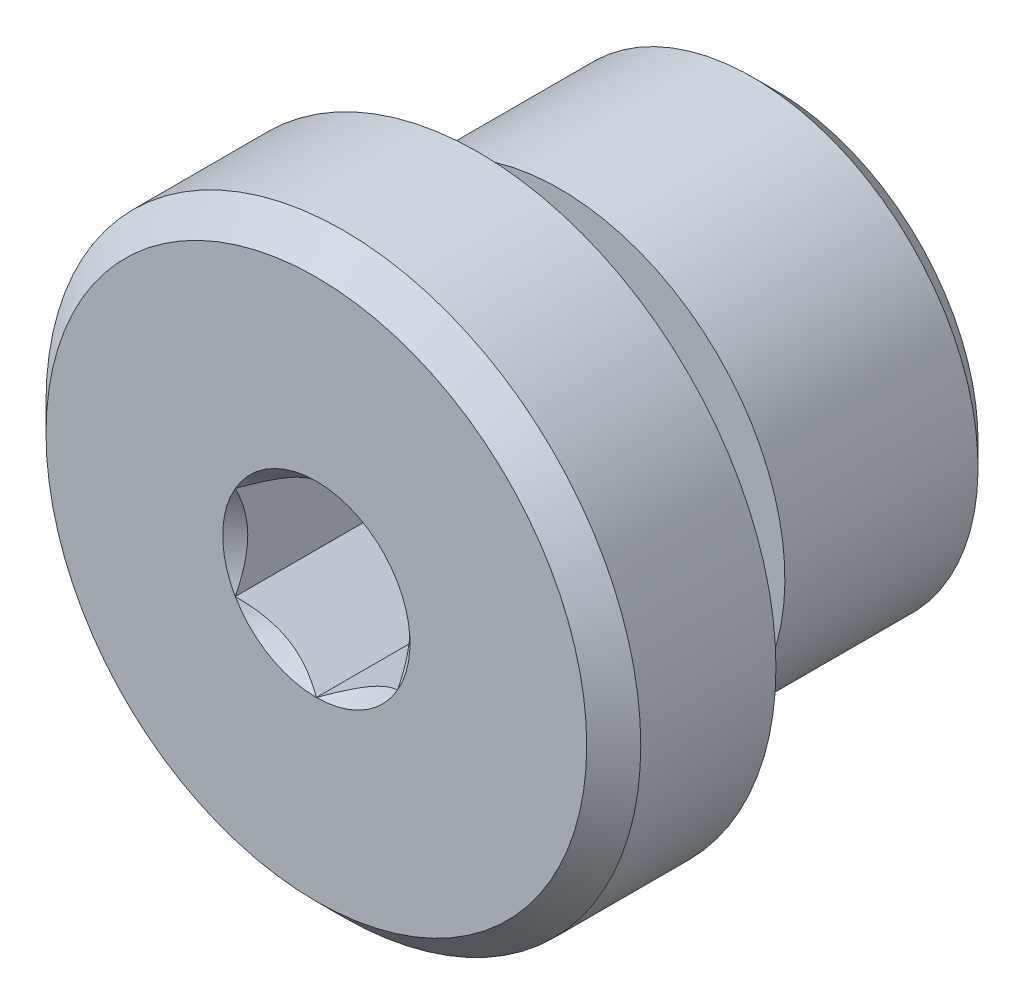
ISO-10303-21;
HEADER;
FILE_DESCRIPTION(('STEP AP214'),'2;1');
FILE_NAME('part.step','',(''),(''),'','','');
FILE_SCHEMA(('AUTOMOTIVE_DESIGN { 1 0 10303 214 1 1 1 1 }'));
ENDSEC;
DATA;
#1=APPLICATION_CONTEXT('core data for automotive mechanical design processes');
#2=APPLICATION_PROTOCOL_DEFINITION('international standard','automotive_design',2000,#1);
#3=PRODUCT_CONTEXT('',#1,'mechanical');
#4=PRODUCT('Part','Part','',(#3));
#5=PRODUCT_RELATED_PRODUCT_CATEGORY('part','',(#4));
#6=PRODUCT_DEFINITION_FORMATION('','',#4);
#7=PRODUCT_DEFINITION_CONTEXT('part definition',#1,'design');
#8=PRODUCT_DEFINITION('design','',#6,#7);
#9=PRODUCT_DEFINITION_SHAPE('','',#8);
#10=(LENGTH_UNIT() NAMED_UNIT(*) SI_UNIT(.MILLI.,.METRE.));
#11=(NAMED_UNIT(*) PLANE_ANGLE_UNIT() SI_UNIT($,.RADIAN.));
#12=(NAMED_UNIT(*) SI_UNIT($,.STERADIAN.) SOLID_ANGLE_UNIT());
#13=UNCERTAINTY_MEASURE_WITH_UNIT(LENGTH_MEASURE(1.E-05),#10,'distance_accuracy_value','');
#14=(GEOMETRIC_REPRESENTATION_CONTEXT(3) GLOBAL_UNCERTAINTY_ASSIGNED_CONTEXT((#13)) GLOBAL_UNIT_ASSIGNED_CONTEXT((#10,
#11,#12)) REPRESENTATION_CONTEXT('',''));
#15=CARTESIAN_POINT('',(0.,0.,0.));
#16=DIRECTION('',(0.,0.,1.));
#17=DIRECTION('',(1.,0.,0.));
#18=AXIS2_PLACEMENT_3D('',#15,#16,#17);
#19=CARTESIAN_POINT('',(0.,0.,0.));
#20=DIRECTION('',(0.,0.,1.));
#21=DIRECTION('',(0.,-1.,0.));
#22=AXIS2_PLACEMENT_3D('',#19,#20,#21);
#23=PLANE('',#22);
#24=DIRECTION('',(-0.866025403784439,0.5,0.));
#25=VECTOR('',#24,1.);
#26=CARTESIAN_POINT('',(3.,1.73205080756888,0.));
#27=LINE('',#26,#25);
#28=CARTESIAN_POINT('',(3.,1.73205080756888,0.));
#29=VERTEX_POINT('',#28);
#30=CARTESIAN_POINT('',(0.,3.46410161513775,0.));
#31=VERTEX_POINT('',#30);
#32=EDGE_CURVE('E64',#29,#31,#27,.T.);
#33=ORIENTED_EDGE('',*,*,#32,.T.);
#34=DIRECTION('',(-0.866025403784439,-0.5,0.));
#35=VECTOR('',#34,1.);
#36=CARTESIAN_POINT('',(0.,3.46410161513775,0.));
#37=LINE('',#36,#35);
#38=CARTESIAN_POINT('',(-3.,1.73205080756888,0.));
#39=VERTEX_POINT('',#38);
#40=EDGE_CURVE('E78',#31,#39,#37,.T.);
#41=ORIENTED_EDGE('',*,*,#40,.T.);
#42=DIRECTION('',(0.,-1.,0.));
#43=VECTOR('',#42,1.);
#44=CARTESIAN_POINT('',(-3.,1.73205080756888,0.));
#45=LINE('',#44,#43);
#46=CARTESIAN_POINT('',(-3.,-1.73205080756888,0.));
#47=VERTEX_POINT('',#46);
#48=EDGE_CURVE('E81',#39,#47,#45,.T.);
#49=ORIENTED_EDGE('',*,*,#48,.T.);
#50=DIRECTION('',(0.866025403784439,-0.5,0.));
#51=VECTOR('',#50,1.);
#52=CARTESIAN_POINT('',(-3.,-1.73205080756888,0.));
#53=LINE('',#52,#51);
#54=CARTESIAN_POINT('',(0.,-3.46410161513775,0.));
#55=VERTEX_POINT('',#54);
#56=EDGE_CURVE('E96',#47,#55,#53,.T.);
#57=ORIENTED_EDGE('',*,*,#56,.T.);
#58=DIRECTION('',(0.866025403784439,0.5,0.));
#59=VECTOR('',#58,1.);
#60=CARTESIAN_POINT('',(0.,-3.46410161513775,0.));
#61=LINE('',#60,#59);
#62=CARTESIAN_POINT('',(3.,-1.73205080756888,0.));
#63=VERTEX_POINT('',#62);
#64=EDGE_CURVE('E272',#55,#63,#61,.T.);
#65=ORIENTED_EDGE('',*,*,#64,.T.);
#66=DIRECTION('',(0.,1.,0.));
#67=VECTOR('',#66,1.);
#68=CARTESIAN_POINT('',(3.,-1.73205080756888,0.));
#69=LINE('',#68,#67);
#70=EDGE_CURVE('E69',#63,#29,#69,.T.);
#71=ORIENTED_EDGE('',*,*,#70,.T.);
#72=EDGE_LOOP('',(#33,#41,#49,#57,#65,#71));
#73=FACE_BOUND('',#72,.T.);
#74=ADVANCED_FACE('F14',(#73),#23,.T.);
#75=CARTESIAN_POINT('',(0.,3.46410161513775,0.));
#76=DIRECTION('',(-0.5,0.866025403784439,0.));
#77=DIRECTION('',(-0.866025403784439,-0.5,0.));
#78=AXIS2_PLACEMENT_3D('',#75,#76,#77);
#79=PLANE('',#78);
#80=ORIENTED_EDGE('',*,*,#40,.F.);
#81=DIRECTION('',(0.,0.,1.));
#82=VECTOR('',#81,1.);
#83=CARTESIAN_POINT('',(0.,3.46410161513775,0.));
#84=LINE('',#83,#82);
#85=CARTESIAN_POINT('',(0.,3.46410161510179,6.00000000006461));
#86=VERTEX_POINT('',#85);
#87=EDGE_CURVE('E56',#31,#86,#84,.T.);
#88=ORIENTED_EDGE('',*,*,#87,.T.);
#89=CARTESIAN_POINT('',(-4.33370467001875E-11,3.46410161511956,6.00000000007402));
#90=CARTESIAN_POINT('',(-0.103111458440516,3.40457018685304,5.94052569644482));
#91=CARTESIAN_POINT('',(-0.207946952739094,3.34404338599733,5.8845449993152));
#92=CARTESIAN_POINT('',(-0.421717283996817,3.22062302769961,5.7820467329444));
#93=CARTESIAN_POINT('',(-0.530672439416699,3.15771773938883,5.73558617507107));
#94=CARTESIAN_POINT('',(-0.750375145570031,3.03087232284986,5.65599891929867));
#95=CARTESIAN_POINT('',(-0.861066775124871,2.96696448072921,5.62267223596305));
#96=CARTESIAN_POINT('',(-1.08488631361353,2.83774220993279,5.57132616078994));
#97=CARTESIAN_POINT('',(-1.19800738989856,2.77243172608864,5.55326845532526));
#98=CARTESIAN_POINT('',(-1.39297651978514,2.65986624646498,5.53697523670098));
#99=CARTESIAN_POINT('',(-1.47457294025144,2.61275653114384,5.53456399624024));
#100=CARTESIAN_POINT('',(-1.63763295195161,2.51861378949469,5.53863151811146));
#101=CARTESIAN_POINT('',(-1.71909648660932,2.47158079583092,5.54511339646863));
#102=CARTESIAN_POINT('',(-1.88125166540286,2.37796045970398,5.56659704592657));
#103=CARTESIAN_POINT('',(-1.96194234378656,2.33137367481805,5.58160834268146));
#104=CARTESIAN_POINT('',(-2.12193782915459,2.2390002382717,5.61933151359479));
#105=CARTESIAN_POINT('',(-2.2012427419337,2.19321352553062,5.64204279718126));
#106=CARTESIAN_POINT('',(-2.34201325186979,2.11193963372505,5.68876371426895));
#107=CARTESIAN_POINT('',(-2.4037908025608,2.07627234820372,5.71154386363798));
#108=CARTESIAN_POINT('',(-2.52623714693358,2.00557791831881,5.76077453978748));
#109=CARTESIAN_POINT('',(-2.58690590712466,1.97055079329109,5.78722517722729));
#110=CARTESIAN_POINT('',(-2.70694350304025,1.90124705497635,5.84320408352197));
#111=CARTESIAN_POINT('',(-2.76631575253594,1.86696847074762,5.87272267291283));
#112=CARTESIAN_POINT('',(-2.88396102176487,1.79904594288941,5.93445005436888));
#113=CARTESIAN_POINT('',(-2.94223468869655,1.76540162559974,5.96665719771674));
#114=CARTESIAN_POINT('',(-2.99999999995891,1.73205080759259,6.00000000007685));
#115=B_SPLINE_CURVE_WITH_KNOTS('',3,(#89,#90,#91,#92,#93,#94,#95,#96,#97,#98,#99,#100,#101,#102,
#103,#104,#105,#106,#107,#108,#109,#110,#111,#112,#113,#114),.UNSPECIFIED.,.F.,.F.,(4,2,2,2,2,2,
2,2,2,2,2,2,4),(0.,0.399548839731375,0.801424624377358,1.19691998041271,1.59141997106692,
1.87377108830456,2.15622116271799,2.43898729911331,2.7217317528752,2.94627735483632,
3.17082972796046,3.39469398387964,3.61842195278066),.UNSPECIFIED.);
#116=CARTESIAN_POINT('',(-2.99999999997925,1.73205080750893,6.00000000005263));
#117=VERTEX_POINT('',#116);
#118=EDGE_CURVE('E17',#86,#117,#115,.T.);
#119=ORIENTED_EDGE('',*,*,#118,.T.);
#120=DIRECTION('',(0.,0.,1.));
#121=VECTOR('',#120,1.);
#122=CARTESIAN_POINT('',(-3.,1.73205080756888,0.));
#123=LINE('',#122,#121);
#124=EDGE_CURVE('E83',#117,#39,#123,.F.);
#125=ORIENTED_EDGE('',*,*,#124,.T.);
#126=EDGE_LOOP('',(#80,#88,#119,#125));
#127=FACE_BOUND('',#126,.T.);
#128=ADVANCED_FACE('F86',(#127),#79,.F.);
#129=CARTESIAN_POINT('',(-3.,1.73205080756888,0.));
#130=DIRECTION('',(-1.,0.,0.));
#131=DIRECTION('',(0.,-1.,0.));
#132=AXIS2_PLACEMENT_3D('',#129,#130,#131);
#133=PLANE('',#132);
#134=ORIENTED_EDGE('',*,*,#48,.F.);
#135=ORIENTED_EDGE('',*,*,#124,.F.);
#136=CARTESIAN_POINT('',(-3.00000000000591,1.73205080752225,6.00000000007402));
#137=CARTESIAN_POINT('',(-3.00000000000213,1.61298795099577,5.94052569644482));
#138=CARTESIAN_POINT('',(-3.00000000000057,1.49193434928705,5.8845449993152));
#139=CARTESIAN_POINT('',(-2.99999999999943,1.24509363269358,5.78204673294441));
#140=CARTESIAN_POINT('',(-2.99999999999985,1.1192830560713,5.73558617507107));
#141=CARTESIAN_POINT('',(-3.00000000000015,0.86559222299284,5.65599891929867));
#142=CARTESIAN_POINT('',(-3.00000000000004,0.737776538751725,5.62267223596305));
#143=CARTESIAN_POINT('',(-2.99999999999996,0.479331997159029,5.57132616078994));
#144=CARTESIAN_POINT('',(-2.99999999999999,0.348711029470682,5.55326845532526));
#145=CARTESIAN_POINT('',(-3.00000000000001,0.123580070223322,5.53697523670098));
#146=CARTESIAN_POINT('',(-3.,0.0293606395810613,5.53456399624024));
#147=CARTESIAN_POINT('',(-3.,-0.158924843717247,5.53863151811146));
#148=CARTESIAN_POINT('',(-3.,-0.252990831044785,5.54511339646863));
#149=CARTESIAN_POINT('',(-3.,-0.440231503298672,5.56659704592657));
#150=CARTESIAN_POINT('',(-3.,-0.533405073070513,5.58160834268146));
#151=CARTESIAN_POINT('',(-3.,-0.718151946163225,5.6193315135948));
#152=CARTESIAN_POINT('',(-3.,-0.809725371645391,5.64204279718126));
#153=CARTESIAN_POINT('',(-3.,-0.972273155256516,5.68876371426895));
#154=CARTESIAN_POINT('',(-3.,-1.04360772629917,5.71154386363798));
#155=CARTESIAN_POINT('',(-3.,-1.184996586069,5.76077453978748));
#156=CARTESIAN_POINT('',(-3.,-1.25505083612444,5.7872251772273));
#157=CARTESIAN_POINT('',(-3.,-1.39365831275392,5.84320408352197));
#158=CARTESIAN_POINT('',(-3.,-1.46221548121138,5.87272267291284));
#159=CARTESIAN_POINT('',(-3.,-1.59806053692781,5.93445005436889));
#160=CARTESIAN_POINT('',(-3.,-1.66534917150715,5.96665719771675));
#161=CARTESIAN_POINT('',(-3.,-1.73205080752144,6.00000000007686));
#162=B_SPLINE_CURVE_WITH_KNOTS('',3,(#136,#137,#138,#139,#140,#141,#142,#143,#144,#145,#146,
#147,#148,#149,#150,#151,#152,#153,#154,#155,#156,#157,#158,#159,#160,#161),.UNSPECIFIED.,.F.,
.F.,(4,2,2,2,2,2,2,2,2,2,2,2,4),(0.,0.399548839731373,0.801424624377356,1.19691998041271,
1.59141997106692,1.87377108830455,2.15622116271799,2.4389872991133,2.7217317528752,
2.94627735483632,3.17082972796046,3.39469398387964,3.61842195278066),.UNSPECIFIED.);
#163=CARTESIAN_POINT('',(-2.99999999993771,-1.73205080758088,6.00000000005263));
#164=VERTEX_POINT('',#163);
#165=EDGE_CURVE('E204',#117,#164,#162,.T.);
#166=ORIENTED_EDGE('',*,*,#165,.T.);
#167=DIRECTION('',(0.,0.,1.));
#168=VECTOR('',#167,1.);
#169=CARTESIAN_POINT('',(-3.,-1.73205080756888,0.));
#170=LINE('',#169,#168);
#171=EDGE_CURVE('E93',#164,#47,#170,.F.);
#172=ORIENTED_EDGE('',*,*,#171,.T.);
#173=EDGE_LOOP('',(#134,#135,#166,#172));
#174=FACE_BOUND('',#173,.T.);
#175=ADVANCED_FACE('F91',(#174),#133,.F.);
#176=CARTESIAN_POINT('',(-3.,-1.73205080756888,0.));
#177=DIRECTION('',(-0.5,-0.866025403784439,0.));
#178=DIRECTION('',(0.866025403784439,-0.5,0.));
#179=AXIS2_PLACEMENT_3D('',#176,#177,#178);
#180=PLANE('',#179);
#181=ORIENTED_EDGE('',*,*,#56,.F.);
#182=ORIENTED_EDGE('',*,*,#171,.F.);
#183=CARTESIAN_POINT('',(-2.99999999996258,-1.73205080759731,6.00000000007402));
#184=CARTESIAN_POINT('',(-2.89688854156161,-1.79158223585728,5.94052569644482));
#185=CARTESIAN_POINT('',(-2.79205304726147,-1.85210903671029,5.8845449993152));
#186=CARTESIAN_POINT('',(-2.57828271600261,-1.97552939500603,5.78204673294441));
#187=CARTESIAN_POINT('',(-2.46932756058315,-2.03843468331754,5.73558617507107));
#188=CARTESIAN_POINT('',(-2.24962485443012,-2.16528009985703,5.65599891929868));
#189=CARTESIAN_POINT('',(-2.13893322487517,-2.22918794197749,5.62267223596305));
#190=CARTESIAN_POINT('',(-1.91511368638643,-2.35841021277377,5.57132616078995));
#191=CARTESIAN_POINT('',(-1.80199261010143,-2.42372069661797,5.55326845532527));
#192=CARTESIAN_POINT('',(-1.60702348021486,-2.53628617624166,5.53697523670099));
#193=CARTESIAN_POINT('',(-1.52542705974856,-2.58339589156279,5.53456399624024));
#194=CARTESIAN_POINT('',(-1.36236704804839,-2.67753863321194,5.53863151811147));
#195=CARTESIAN_POINT('',(-1.28090351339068,-2.72457162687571,5.54511339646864));
#196=CARTESIAN_POINT('',(-1.11874833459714,-2.81819196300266,5.56659704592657));
#197=CARTESIAN_POINT('',(-1.03805765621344,-2.86477874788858,5.58160834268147));
#198=CARTESIAN_POINT('',(-0.87806217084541,-2.95715218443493,5.6193315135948));
#199=CARTESIAN_POINT('',(-0.798757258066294,-3.00293889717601,5.64204279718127));
#200=CARTESIAN_POINT('',(-0.657986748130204,-3.08421278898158,5.68876371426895));
#201=CARTESIAN_POINT('',(-0.596209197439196,-3.11988007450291,5.71154386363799));
#202=CARTESIAN_POINT('',(-0.473762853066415,-3.19057450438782,5.76077453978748));
#203=CARTESIAN_POINT('',(-0.413094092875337,-3.22560162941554,5.7872251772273));
#204=CARTESIAN_POINT('',(-0.293056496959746,-3.29490536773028,5.84320408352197));
#205=CARTESIAN_POINT('',(-0.233684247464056,-3.32918395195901,5.87272267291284));
#206=CARTESIAN_POINT('',(-0.116038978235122,-3.39710647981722,5.93445005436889));
#207=CARTESIAN_POINT('',(-0.0577653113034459,-3.43075079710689,5.96665719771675));
#208=CARTESIAN_POINT('',(-4.10878878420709E-11,-3.46410161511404,6.00000000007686));
#209=B_SPLINE_CURVE_WITH_KNOTS('',3,(#183,#184,#185,#186,#187,#188,#189,#190,#191,#192,#193,
#194,#195,#196,#197,#198,#199,#200,#201,#202,#203,#204,#205,#206,#207,#208),.UNSPECIFIED.,.F.,
.F.,(4,2,2,2,2,2,2,2,2,2,2,2,4),(0.,0.399548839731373,0.801424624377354,1.19691998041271,
1.59141997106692,1.87377108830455,2.15622116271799,2.4389872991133,2.7217317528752,
2.94627735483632,3.17082972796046,3.39469398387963,3.61842195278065),.UNSPECIFIED.);
#210=CARTESIAN_POINT('',(4.1533280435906E-11,-3.46410161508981,6.00000000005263));
#211=VERTEX_POINT('',#210);
#212=EDGE_CURVE('E184',#164,#211,#209,.T.);
#213=ORIENTED_EDGE('',*,*,#212,.T.);
#214=DIRECTION('',(0.,0.,1.));
#215=VECTOR('',#214,1.);
#216=CARTESIAN_POINT('',(0.,-3.46410161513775,0.));
#217=LINE('',#216,#215);
#218=EDGE_CURVE('E273',#211,#55,#217,.F.);
#219=ORIENTED_EDGE('',*,*,#218,.T.);
#220=EDGE_LOOP('',(#181,#182,#213,#219));
#221=FACE_BOUND('',#220,.T.);
#222=ADVANCED_FACE('F194',(#221),#180,.F.);
#223=CARTESIAN_POINT('',(0.,-3.46410161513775,0.));
#224=DIRECTION('',(0.5,-0.866025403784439,0.));
#225=DIRECTION('',(0.866025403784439,0.5,0.));
#226=AXIS2_PLACEMENT_3D('',#223,#224,#225);
#227=PLANE('',#226);
#228=ORIENTED_EDGE('',*,*,#64,.F.);
#229=ORIENTED_EDGE('',*,*,#218,.F.);
#230=CARTESIAN_POINT('',(4.33330643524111E-11,-3.46410161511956,6.00000000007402));
#231=CARTESIAN_POINT('',(0.103111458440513,-3.40457018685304,5.94052569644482));
#232=CARTESIAN_POINT('',(0.207946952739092,-3.34404338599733,5.8845449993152));
#233=CARTESIAN_POINT('',(0.421717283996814,-3.22062302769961,5.78204673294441));
#234=CARTESIAN_POINT('',(0.530672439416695,-3.15771773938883,5.73558617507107));
#235=CARTESIAN_POINT('',(0.750375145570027,-3.03087232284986,5.65599891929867));
#236=CARTESIAN_POINT('',(0.861066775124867,-2.96696448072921,5.62267223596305));
#237=CARTESIAN_POINT('',(1.08488631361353,-2.83774220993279,5.57132616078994));
#238=CARTESIAN_POINT('',(1.19800738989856,-2.77243172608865,5.55326845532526));
#239=CARTESIAN_POINT('',(1.39297651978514,-2.65986624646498,5.53697523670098));
#240=CARTESIAN_POINT('',(1.47457294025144,-2.61275653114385,5.53456399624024));
#241=CARTESIAN_POINT('',(1.6376329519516,-2.51861378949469,5.53863151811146));
#242=CARTESIAN_POINT('',(1.71909648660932,-2.47158079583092,5.54511339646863));
#243=CARTESIAN_POINT('',(1.88125166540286,-2.37796045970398,5.56659704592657));
#244=CARTESIAN_POINT('',(1.96194234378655,-2.33137367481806,5.58160834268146));
#245=CARTESIAN_POINT('',(2.12193782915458,-2.2390002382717,5.61933151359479));
#246=CARTESIAN_POINT('',(2.2012427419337,-2.19321352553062,5.64204279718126));
#247=CARTESIAN_POINT('',(2.34201325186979,-2.11193963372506,5.68876371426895));
#248=CARTESIAN_POINT('',(2.4037908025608,-2.07627234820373,5.71154386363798));
#249=CARTESIAN_POINT('',(2.52623714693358,-2.00557791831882,5.76077453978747));
#250=CARTESIAN_POINT('',(2.58690590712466,-1.9705507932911,5.78722517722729));
#251=CARTESIAN_POINT('',(2.70694350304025,-1.90124705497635,5.84320408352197));
#252=CARTESIAN_POINT('',(2.76631575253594,-1.86696847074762,5.87272267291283));
#253=CARTESIAN_POINT('',(2.88396102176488,-1.79904594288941,5.93445005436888));
#254=CARTESIAN_POINT('',(2.94223468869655,-1.76540162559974,5.96665719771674));
#255=CARTESIAN_POINT('',(2.99999999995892,-1.73205080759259,6.00000000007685));
#256=B_SPLINE_CURVE_WITH_KNOTS('',3,(#230,#231,#232,#233,#234,#235,#236,#237,#238,#239,#240,
#241,#242,#243,#244,#245,#246,#247,#248,#249,#250,#251,#252,#253,#254,#255),.UNSPECIFIED.,.F.,
.F.,(4,2,2,2,2,2,2,2,2,2,2,2,4),(0.,0.399548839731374,0.801424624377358,1.19691998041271,
1.59141997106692,1.87377108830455,2.15622116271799,2.4389872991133,2.7217317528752,
2.94627735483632,3.17082972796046,3.39469398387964,3.61842195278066),.UNSPECIFIED.);
#257=CARTESIAN_POINT('',(2.99999999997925,-1.73205080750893,6.00000000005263));
#258=VERTEX_POINT('',#257);
#259=EDGE_CURVE('E177',#211,#258,#256,.T.);
#260=ORIENTED_EDGE('',*,*,#259,.T.);
#261=DIRECTION('',(0.,0.,1.));
#262=VECTOR('',#261,1.);
#263=CARTESIAN_POINT('',(3.,-1.73205080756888,0.));
#264=LINE('',#263,#262);
#265=EDGE_CURVE('E269',#258,#63,#264,.F.);
#266=ORIENTED_EDGE('',*,*,#265,.T.);
#267=EDGE_LOOP('',(#228,#229,#260,#266));
#268=FACE_BOUND('',#267,.T.);
#269=ADVANCED_FACE('F190',(#268),#227,.F.);
#270=CARTESIAN_POINT('',(3.,-1.73205080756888,0.));
#271=DIRECTION('',(1.,0.,0.));
#272=DIRECTION('',(0.,1.,0.));
#273=AXIS2_PLACEMENT_3D('',#270,#271,#272);
#274=PLANE('',#273);
#275=ORIENTED_EDGE('',*,*,#70,.F.);
#276=ORIENTED_EDGE('',*,*,#265,.F.);
#277=CARTESIAN_POINT('',(3.00000000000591,-1.73205080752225,6.00000000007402));
#278=CARTESIAN_POINT('',(3.00000000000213,-1.61298795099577,5.94052569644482));
#279=CARTESIAN_POINT('',(3.00000000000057,-1.49193434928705,5.8845449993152));
#280=CARTESIAN_POINT('',(2.99999999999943,-1.24509363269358,5.78204673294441));
#281=CARTESIAN_POINT('',(2.99999999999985,-1.11928305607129,5.73558617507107));
#282=CARTESIAN_POINT('',(3.00000000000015,-0.865592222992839,5.65599891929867));
#283=CARTESIAN_POINT('',(3.00000000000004,-0.737776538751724,5.62267223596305));
#284=CARTESIAN_POINT('',(2.99999999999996,-0.479331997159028,5.57132616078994));
#285=CARTESIAN_POINT('',(2.99999999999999,-0.348711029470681,5.55326845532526));
#286=CARTESIAN_POINT('',(3.00000000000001,-0.123580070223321,5.53697523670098));
#287=CARTESIAN_POINT('',(3.,-0.0293606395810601,5.53456399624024));
#288=CARTESIAN_POINT('',(3.,0.158924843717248,5.53863151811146));
#289=CARTESIAN_POINT('',(3.,0.252990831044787,5.54511339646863));
#290=CARTESIAN_POINT('',(3.,0.440231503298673,5.56659704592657));
#291=CARTESIAN_POINT('',(3.,0.533405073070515,5.58160834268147));
#292=CARTESIAN_POINT('',(3.,0.718151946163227,5.6193315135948));
#293=CARTESIAN_POINT('',(3.,0.809725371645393,5.64204279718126));
#294=CARTESIAN_POINT('',(3.,0.972273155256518,5.68876371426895));
#295=CARTESIAN_POINT('',(3.,1.04360772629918,5.71154386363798));
#296=CARTESIAN_POINT('',(3.,1.184996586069,5.76077453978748));
#297=CARTESIAN_POINT('',(3.,1.25505083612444,5.7872251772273));
#298=CARTESIAN_POINT('',(3.,1.39365831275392,5.84320408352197));
#299=CARTESIAN_POINT('',(3.,1.46221548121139,5.87272267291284));
#300=CARTESIAN_POINT('',(3.,1.59806053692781,5.93445005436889));
#301=CARTESIAN_POINT('',(3.,1.66534917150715,5.96665719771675));
#302=CARTESIAN_POINT('',(3.,1.73205080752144,6.00000000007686));
#303=B_SPLINE_CURVE_WITH_KNOTS('',3,(#277,#278,#279,#280,#281,#282,#283,#284,#285,#286,#287,
#288,#289,#290,#291,#292,#293,#294,#295,#296,#297,#298,#299,#300,#301,#302),.UNSPECIFIED.,.F.,
.F.,(4,2,2,2,2,2,2,2,2,2,2,2,4),(0.,0.399548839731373,0.801424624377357,1.19691998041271,
1.59141997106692,1.87377108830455,2.15622116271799,2.43898729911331,2.7217317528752,
2.94627735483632,3.17082972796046,3.39469398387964,3.61842195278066),.UNSPECIFIED.);
#304=CARTESIAN_POINT('',(2.99999999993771,1.73205080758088,6.00000000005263));
#305=VERTEX_POINT('',#304);
#306=EDGE_CURVE('E37',#258,#305,#303,.T.);
#307=ORIENTED_EDGE('',*,*,#306,.T.);
#308=DIRECTION('',(0.,0.,1.));
#309=VECTOR('',#308,1.);
#310=CARTESIAN_POINT('',(3.,1.73205080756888,0.));
#311=LINE('',#310,#309);
#312=EDGE_CURVE('E267',#305,#29,#311,.F.);
#313=ORIENTED_EDGE('',*,*,#312,.T.);
#314=EDGE_LOOP('',(#275,#276,#307,#313));
#315=FACE_BOUND('',#314,.T.);
#316=ADVANCED_FACE('F193',(#315),#274,.F.);
#317=CARTESIAN_POINT('',(3.,1.73205080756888,0.));
#318=DIRECTION('',(0.5,0.866025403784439,0.));
#319=DIRECTION('',(-0.866025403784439,0.5,0.));
#320=AXIS2_PLACEMENT_3D('',#317,#318,#319);
#321=PLANE('',#320);
#322=ORIENTED_EDGE('',*,*,#32,.F.);
#323=ORIENTED_EDGE('',*,*,#312,.F.);
#324=CARTESIAN_POINT('',(2.99999999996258,1.73205080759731,6.00000000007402));
#325=CARTESIAN_POINT('',(2.89688854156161,1.79158223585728,5.94052569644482));
#326=CARTESIAN_POINT('',(2.79205304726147,1.85210903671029,5.8845449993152));
#327=CARTESIAN_POINT('',(2.57828271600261,1.97552939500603,5.78204673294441));
#328=CARTESIAN_POINT('',(2.46932756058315,2.03843468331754,5.73558617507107));
#329=CARTESIAN_POINT('',(2.24962485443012,2.16528009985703,5.65599891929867));
#330=CARTESIAN_POINT('',(2.13893322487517,2.22918794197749,5.62267223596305));
#331=CARTESIAN_POINT('',(1.91511368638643,2.35841021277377,5.57132616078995));
#332=CARTESIAN_POINT('',(1.80199261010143,2.42372069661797,5.55326845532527));
#333=CARTESIAN_POINT('',(1.60702348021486,2.53628617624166,5.53697523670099));
#334=CARTESIAN_POINT('',(1.52542705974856,2.58339589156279,5.53456399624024));
#335=CARTESIAN_POINT('',(1.36236704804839,2.67753863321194,5.53863151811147));
#336=CARTESIAN_POINT('',(1.28090351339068,2.72457162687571,5.54511339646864));
#337=CARTESIAN_POINT('',(1.11874833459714,2.81819196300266,5.56659704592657));
#338=CARTESIAN_POINT('',(1.03805765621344,2.86477874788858,5.58160834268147));
#339=CARTESIAN_POINT('',(0.878062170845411,2.95715218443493,5.6193315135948));
#340=CARTESIAN_POINT('',(0.798757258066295,3.00293889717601,5.64204279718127));
#341=CARTESIAN_POINT('',(0.657986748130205,3.08421278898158,5.68876371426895));
#342=CARTESIAN_POINT('',(0.596209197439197,3.11988007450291,5.71154386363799));
#343=CARTESIAN_POINT('',(0.473762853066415,3.19057450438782,5.76077453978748));
#344=CARTESIAN_POINT('',(0.413094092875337,3.22560162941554,5.7872251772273));
#345=CARTESIAN_POINT('',(0.293056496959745,3.29490536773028,5.84320408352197));
#346=CARTESIAN_POINT('',(0.233684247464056,3.32918395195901,5.87272267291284));
#347=CARTESIAN_POINT('',(0.116038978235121,3.39710647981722,5.93445005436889));
#348=CARTESIAN_POINT('',(0.0577653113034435,3.43075079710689,5.96665719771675));
#349=CARTESIAN_POINT('',(4.10838451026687E-11,3.46410161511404,6.00000000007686));
#350=B_SPLINE_CURVE_WITH_KNOTS('',3,(#324,#325,#326,#327,#328,#329,#330,#331,#332,#333,#334,
#335,#336,#337,#338,#339,#340,#341,#342,#343,#344,#345,#346,#347,#348,#349),.UNSPECIFIED.,.F.,
.F.,(4,2,2,2,2,2,2,2,2,2,2,2,4),(0.,0.399548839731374,0.801424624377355,1.19691998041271,
1.59141997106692,1.87377108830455,2.15622116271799,2.4389872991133,2.7217317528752,
2.94627735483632,3.17082972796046,3.39469398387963,3.61842195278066),.UNSPECIFIED.);
#351=EDGE_CURVE('E140',#305,#86,#350,.T.);
#352=ORIENTED_EDGE('',*,*,#351,.T.);
#353=ORIENTED_EDGE('',*,*,#87,.F.);
#354=EDGE_LOOP('',(#322,#323,#352,#353));
#355=FACE_BOUND('',#354,.T.);
#356=ADVANCED_FACE('F155',(#355),#321,.F.);
#357=CARTESIAN_POINT('',(0.,0.,6.00000000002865));
#358=DIRECTION('',(0.,0.,1.));
#359=DIRECTION('',(0.,-1.,0.));
#360=AXIS2_PLACEMENT_3D('',#357,#358,#359);
#361=CONICAL_SURFACE('',#360,3.46410161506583,0.785398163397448);
#362=ORIENTED_EDGE('',*,*,#118,.F.);
#363=CARTESIAN_POINT('',(0.,0.,6.00000000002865));
#364=DIRECTION('',(0.,0.,1.));
#365=DIRECTION('',(0.,-1.,0.));
#366=AXIS2_PLACEMENT_3D('',#363,#364,#365);
#367=CIRCLE('',#366,3.46410161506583);
#368=EDGE_CURVE('E138',#86,#117,#367,.T.);
#369=ORIENTED_EDGE('',*,*,#368,.T.);
#370=EDGE_LOOP('',(#362,#369));
#371=FACE_BOUND('',#370,.T.);
#372=ADVANCED_FACE('F212',(#371),#361,.F.);
#373=CARTESIAN_POINT('',(0.,0.,6.00000000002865));
#374=DIRECTION('',(0.,0.,1.));
#375=DIRECTION('',(0.,-1.,0.));
#376=AXIS2_PLACEMENT_3D('',#373,#374,#375);
#377=CONICAL_SURFACE('',#376,3.46410161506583,0.785398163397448);
#378=ORIENTED_EDGE('',*,*,#165,.F.);
#379=CARTESIAN_POINT('',(0.,0.,6.00000000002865));
#380=DIRECTION('',(0.,0.,1.));
#381=DIRECTION('',(0.,-1.,0.));
#382=AXIS2_PLACEMENT_3D('',#379,#380,#381);
#383=CIRCLE('',#382,3.46410161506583);
#384=EDGE_CURVE('E135',#117,#164,#383,.T.);
#385=ORIENTED_EDGE('',*,*,#384,.T.);
#386=EDGE_LOOP('',(#378,#385));
#387=FACE_BOUND('',#386,.T.);
#388=ADVANCED_FACE('F209',(#387),#377,.F.);
#389=CARTESIAN_POINT('',(0.,0.,6.00000000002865));
#390=DIRECTION('',(0.,0.,1.));
#391=DIRECTION('',(0.,-1.,0.));
#392=AXIS2_PLACEMENT_3D('',#389,#390,#391);
#393=CONICAL_SURFACE('',#392,3.46410161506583,0.785398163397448);
#394=ORIENTED_EDGE('',*,*,#212,.F.);
#395=CARTESIAN_POINT('',(0.,0.,6.00000000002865));
#396=DIRECTION('',(0.,0.,1.));
#397=DIRECTION('',(0.,-1.,0.));
#398=AXIS2_PLACEMENT_3D('',#395,#396,#397);
#399=CIRCLE('',#398,3.46410161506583);
#400=EDGE_CURVE('E132',#164,#211,#399,.T.);
#401=ORIENTED_EDGE('',*,*,#400,.T.);
#402=EDGE_LOOP('',(#394,#401));
#403=FACE_BOUND('',#402,.T.);
#404=ADVANCED_FACE('F173',(#403),#393,.F.);
#405=CARTESIAN_POINT('',(0.,0.,6.00000000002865));
#406=DIRECTION('',(0.,0.,1.));
#407=DIRECTION('',(0.,-1.,0.));
#408=AXIS2_PLACEMENT_3D('',#405,#406,#407);
#409=CONICAL_SURFACE('',#408,3.46410161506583,0.785398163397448);
#410=ORIENTED_EDGE('',*,*,#259,.F.);
#411=CARTESIAN_POINT('',(0.,0.,6.00000000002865));
#412=DIRECTION('',(0.,0.,1.));
#413=DIRECTION('',(0.,-1.,0.));
#414=AXIS2_PLACEMENT_3D('',#411,#412,#413);
#415=CIRCLE('',#414,3.46410161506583);
#416=EDGE_CURVE('E129',#211,#258,#415,.T.);
#417=ORIENTED_EDGE('',*,*,#416,.T.);
#418=EDGE_LOOP('',(#410,#417));
#419=FACE_BOUND('',#418,.T.);
#420=ADVANCED_FACE('F168',(#419),#409,.F.);
#421=CARTESIAN_POINT('',(0.,0.,6.00000000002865));
#422=DIRECTION('',(0.,0.,1.));
#423=DIRECTION('',(0.,-1.,0.));
#424=AXIS2_PLACEMENT_3D('',#421,#422,#423);
#425=CONICAL_SURFACE('',#424,3.46410161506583,0.785398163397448);
#426=ORIENTED_EDGE('',*,*,#306,.F.);
#427=CARTESIAN_POINT('',(0.,0.,6.00000000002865));
#428=DIRECTION('',(0.,0.,1.));
#429=DIRECTION('',(0.,-1.,0.));
#430=AXIS2_PLACEMENT_3D('',#427,#428,#429);
#431=CIRCLE('',#430,3.46410161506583);
#432=EDGE_CURVE('E126',#258,#305,#431,.T.);
#433=ORIENTED_EDGE('',*,*,#432,.T.);
#434=EDGE_LOOP('',(#426,#433));
#435=FACE_BOUND('',#434,.T.);
#436=ADVANCED_FACE('F162',(#435),#425,.F.);
#437=CARTESIAN_POINT('',(0.,0.,6.00000000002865));
#438=DIRECTION('',(0.,0.,1.));
#439=DIRECTION('',(0.,-1.,0.));
#440=AXIS2_PLACEMENT_3D('',#437,#438,#439);
#441=CONICAL_SURFACE('',#440,3.46410161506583,0.785398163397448);
#442=ORIENTED_EDGE('',*,*,#351,.F.);
#443=CARTESIAN_POINT('',(0.,0.,6.00000000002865));
#444=DIRECTION('',(0.,0.,1.));
#445=DIRECTION('',(0.,-1.,0.));
#446=AXIS2_PLACEMENT_3D('',#443,#444,#445);
#447=CIRCLE('',#446,3.46410161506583);
#448=EDGE_CURVE('E123',#305,#86,#447,.T.);
#449=ORIENTED_EDGE('',*,*,#448,.T.);
#450=EDGE_LOOP('',(#442,#449));
#451=FACE_BOUND('',#450,.T.);
#452=ADVANCED_FACE('F157',(#451),#441,.F.);
#453=CARTESIAN_POINT('',(3.46410161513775,0.,6.));
#454=DIRECTION('',(0.,0.,-1.));
#455=DIRECTION('',(0.,1.,0.));
#456=AXIS2_PLACEMENT_3D('',#453,#454,#455);
#457=PLANE('',#456);
#458=ORIENTED_EDGE('',*,*,#432,.F.);
#459=ORIENTED_EDGE('',*,*,#416,.F.);
#460=ORIENTED_EDGE('',*,*,#400,.F.);
#461=ORIENTED_EDGE('',*,*,#384,.F.);
#462=ORIENTED_EDGE('',*,*,#368,.F.);
#463=ORIENTED_EDGE('',*,*,#448,.F.);
#464=EDGE_LOOP('',(#458,#459,#460,#461,#462,#463));
#465=FACE_BOUND('',#464,.T.);
#466=CARTESIAN_POINT('',(0.,0.,6.));
#467=DIRECTION('',(0.,0.,-1.));
#468=DIRECTION('',(0.,1.,0.));
#469=AXIS2_PLACEMENT_3D('',#466,#467,#468);
#470=CIRCLE('',#469,10.);
#471=CARTESIAN_POINT('',(0.,10.,6.));
#472=VERTEX_POINT('',#471);
#473=EDGE_CURVE('E120',#472,#472,#470,.T.);
#474=ORIENTED_EDGE('',*,*,#473,.F.);
#475=EDGE_LOOP('',(#474));
#476=FACE_BOUND('',#475,.T.);
#477=ADVANCED_FACE('F161',(#465,#476),#457,.F.);
#478=CARTESIAN_POINT('',(0.,0.,5.));
#479=DIRECTION('',(0.,0.,-1.));
#480=DIRECTION('',(0.,1.,0.));
#481=AXIS2_PLACEMENT_3D('',#478,#479,#480);
#482=CONICAL_SURFACE('',#481,11.,0.785398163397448);
#483=ORIENTED_EDGE('',*,*,#473,.T.);
#484=EDGE_LOOP('',(#483));
#485=FACE_BOUND('',#484,.T.);
#486=CARTESIAN_POINT('',(0.,0.,5.));
#487=DIRECTION('',(0.,0.,1.));
#488=DIRECTION('',(0.,-1.,0.));
#489=AXIS2_PLACEMENT_3D('',#486,#487,#488);
#490=CIRCLE('',#489,11.);
#491=CARTESIAN_POINT('',(0.,-11.,5.));
#492=VERTEX_POINT('',#491);
#493=EDGE_CURVE('E119',#492,#492,#490,.F.);
#494=ORIENTED_EDGE('',*,*,#493,.F.);
#495=EDGE_LOOP('',(#494));
#496=FACE_BOUND('',#495,.T.);
#497=ADVANCED_FACE('F317',(#485,#496),#482,.T.);
#498=CARTESIAN_POINT('',(0.,0.,-11.));
#499=DIRECTION('',(0.,0.,1.));
#500=DIRECTION('',(0.,-1.,0.));
#501=AXIS2_PLACEMENT_3D('',#498,#499,#500);
#502=CYLINDRICAL_SURFACE('',#501,11.);
#503=ORIENTED_EDGE('',*,*,#493,.T.);
#504=EDGE_LOOP('',(#503));
#505=FACE_BOUND('',#504,.T.);
#506=CARTESIAN_POINT('',(0.,0.,0.));
#507=DIRECTION('',(0.,0.,1.));
#508=DIRECTION('',(0.,-1.,0.));
#509=AXIS2_PLACEMENT_3D('',#506,#507,#508);
#510=CIRCLE('',#509,11.);
#511=CARTESIAN_POINT('',(0.,-11.,0.));
#512=VERTEX_POINT('',#511);
#513=EDGE_CURVE('E116',#512,#512,#510,.T.);
#514=ORIENTED_EDGE('',*,*,#513,.T.);
#515=EDGE_LOOP('',(#514));
#516=FACE_BOUND('',#515,.T.);
#517=ADVANCED_FACE('F323',(#505,#516),#502,.T.);
#518=CARTESIAN_POINT('',(11.,0.,0.));
#519=DIRECTION('',(0.,0.,1.));
#520=DIRECTION('',(0.,-1.,0.));
#521=AXIS2_PLACEMENT_3D('',#518,#519,#520);
#522=PLANE('',#521);
#523=ORIENTED_EDGE('',*,*,#513,.F.);
#524=EDGE_LOOP('',(#523));
#525=FACE_BOUND('',#524,.T.);
#526=CARTESIAN_POINT('',(0.,0.,0.));
#527=DIRECTION('',(0.,0.,-1.));
#528=DIRECTION('',(0.,1.,0.));
#529=AXIS2_PLACEMENT_3D('',#526,#527,#528);
#530=CIRCLE('',#529,9.34614813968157);
#531=CARTESIAN_POINT('',(0.,9.34614813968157,0.));
#532=VERTEX_POINT('',#531);
#533=EDGE_CURVE('E113',#532,#532,#530,.T.);
#534=ORIENTED_EDGE('',*,*,#533,.F.);
#535=EDGE_LOOP('',(#534));
#536=FACE_BOUND('',#535,.T.);
#537=ADVANCED_FACE('F254',(#525,#536),#522,.F.);
#538=CARTESIAN_POINT('',(0.,0.,0.65));
#539=DIRECTION('',(0.,0.,-1.));
#540=DIRECTION('',(0.,1.,0.));
#541=AXIS2_PLACEMENT_3D('',#538,#539,#540);
#542=TOROIDAL_SURFACE('',#541,8.05,1.45);
#543=CARTESIAN_POINT('',(0.,0.,0.));
#544=DIRECTION('',(0.,0.,-1.));
#545=DIRECTION('',(0.,1.,0.));
#546=AXIS2_PLACEMENT_3D('',#543,#544,#545);
#547=CIRCLE('',#546,6.75385186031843);
#548=CARTESIAN_POINT('',(0.,6.75385186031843,0.));
#549=VERTEX_POINT('',#548);
#550=EDGE_CURVE('E110',#549,#549,#547,.F.);
#551=ORIENTED_EDGE('',*,*,#550,.T.);
#552=EDGE_LOOP('',(#551));
#553=FACE_BOUND('',#552,.T.);
#554=ORIENTED_EDGE('',*,*,#533,.T.);
#555=EDGE_LOOP('',(#554));
#556=FACE_BOUND('',#555,.T.);
#557=ADVANCED_FACE('F249',(#553,#556),#542,.T.);
#558=CARTESIAN_POINT('',(11.,0.,0.));
#559=DIRECTION('',(0.,0.,1.));
#560=DIRECTION('',(0.,-1.,0.));
#561=AXIS2_PLACEMENT_3D('',#558,#559,#560);
#562=PLANE('',#561);
#563=ORIENTED_EDGE('',*,*,#550,.F.);
#564=EDGE_LOOP('',(#563));
#565=FACE_BOUND('',#564,.T.);
#566=CARTESIAN_POINT('',(0.,0.,0.));
#567=DIRECTION('',(0.,0.,1.));
#568=DIRECTION('',(0.,-1.,0.));
#569=AXIS2_PLACEMENT_3D('',#566,#567,#568);
#570=CIRCLE('',#569,6.6);
#571=CARTESIAN_POINT('',(0.,-6.6,0.));
#572=VERTEX_POINT('',#571);
#573=EDGE_CURVE('E107',#572,#572,#570,.F.);
#574=ORIENTED_EDGE('',*,*,#573,.F.);
#575=EDGE_LOOP('',(#574));
#576=FACE_BOUND('',#575,.T.);
#577=ADVANCED_FACE('F245',(#565,#576),#562,.F.);
#578=CARTESIAN_POINT('',(7.475,0.,-11.));
#579=DIRECTION('',(0.,0.,1.));
#580=DIRECTION('',(0.,-1.,0.));
#581=AXIS2_PLACEMENT_3D('',#578,#579,#580);
#582=PLANE('',#581);
#583=CARTESIAN_POINT('',(0.,0.,-11.));
#584=DIRECTION('',(0.,0.,1.));
#585=DIRECTION('',(0.,-1.,0.));
#586=AXIS2_PLACEMENT_3D('',#583,#584,#585);
#587=CIRCLE('',#586,7.475);
#588=CARTESIAN_POINT('',(0.,-7.475,-11.));
#589=VERTEX_POINT('',#588);
#590=EDGE_CURVE('E104',#589,#589,#587,.T.);
#591=ORIENTED_EDGE('',*,*,#590,.F.);
#592=EDGE_LOOP('',(#591));
#593=FACE_BOUND('',#592,.T.);
#594=ADVANCED_FACE('F241',(#593),#582,.F.);
#595=CARTESIAN_POINT('',(0.,0.,-11.));
#596=DIRECTION('',(0.,0.,1.));
#597=DIRECTION('',(0.,-1.,0.));
#598=AXIS2_PLACEMENT_3D('',#595,#596,#597);
#599=CYLINDRICAL_SURFACE('',#598,6.6);
#600=ORIENTED_EDGE('',*,*,#573,.T.);
#601=EDGE_LOOP('',(#600));
#602=FACE_BOUND('',#601,.T.);
#603=CARTESIAN_POINT('',(0.,0.,-3.));
#604=DIRECTION('',(0.,0.,1.));
#605=DIRECTION('',(0.,-1.,0.));
#606=AXIS2_PLACEMENT_3D('',#603,#604,#605);
#607=CIRCLE('',#606,6.6);
#608=CARTESIAN_POINT('',(0.,-6.6,-3.));
#609=VERTEX_POINT('',#608);
#610=EDGE_CURVE('E101',#609,#609,#607,.T.);
#611=ORIENTED_EDGE('',*,*,#610,.T.);
#612=EDGE_LOOP('',(#611));
#613=FACE_BOUND('',#612,.T.);
#614=ADVANCED_FACE('F237',(#602,#613),#599,.T.);
#615=CARTESIAN_POINT('',(0.,0.,-10.144));
#616=DIRECTION('',(0.,0.,1.));
#617=DIRECTION('',(0.,-1.,0.));
#618=AXIS2_PLACEMENT_3D('',#615,#616,#617);
#619=CONICAL_SURFACE('',#618,8.331,0.785398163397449);
#620=CARTESIAN_POINT('',(0.,0.,-10.144));
#621=DIRECTION('',(0.,0.,1.));
#622=DIRECTION('',(0.,-1.,0.));
#623=AXIS2_PLACEMENT_3D('',#620,#621,#622);
#624=CIRCLE('',#623,8.331);
#625=CARTESIAN_POINT('',(0.,-8.331,-10.144));
#626=VERTEX_POINT('',#625);
#627=EDGE_CURVE('E28',#626,#626,#624,.T.);
#628=ORIENTED_EDGE('',*,*,#627,.F.);
#629=EDGE_LOOP('',(#628));
#630=FACE_BOUND('',#629,.T.);
#631=ORIENTED_EDGE('',*,*,#590,.T.);
#632=EDGE_LOOP('',(#631));
#633=FACE_BOUND('',#632,.T.);
#634=ADVANCED_FACE('F230',(#630,#633),#619,.T.);
#635=CARTESIAN_POINT('',(6.6,0.,-3.));
#636=DIRECTION('',(0.,0.,-1.));
#637=DIRECTION('',(0.,1.,0.));
#638=AXIS2_PLACEMENT_3D('',#635,#636,#637);
#639=PLANE('',#638);
#640=ORIENTED_EDGE('',*,*,#610,.F.);
#641=EDGE_LOOP('',(#640));
#642=FACE_BOUND('',#641,.T.);
#643=CARTESIAN_POINT('',(0.,0.,-3.));
#644=DIRECTION('',(0.,0.,1.));
#645=DIRECTION('',(0.,-1.,0.));
#646=AXIS2_PLACEMENT_3D('',#643,#644,#645);
#647=CIRCLE('',#646,8.331);
#648=CARTESIAN_POINT('',(0.,-8.331,-3.));
#649=VERTEX_POINT('',#648);
#650=EDGE_CURVE('E9',#649,#649,#647,.F.);
#651=ORIENTED_EDGE('',*,*,#650,.F.);
#652=EDGE_LOOP('',(#651));
#653=FACE_BOUND('',#652,.T.);
#654=ADVANCED_FACE('F224',(#642,#653),#639,.F.);
#655=CARTESIAN_POINT('',(0.,0.,-11.));
#656=DIRECTION('',(0.,0.,1.));
#657=DIRECTION('',(0.,-1.,0.));
#658=AXIS2_PLACEMENT_3D('',#655,#656,#657);
#659=CYLINDRICAL_SURFACE('',#658,8.331);
#660=ORIENTED_EDGE('',*,*,#650,.T.);
#661=EDGE_LOOP('',(#660));
#662=FACE_BOUND('',#661,.T.);
#663=ORIENTED_EDGE('',*,*,#627,.T.);
#664=EDGE_LOOP('',(#663));
#665=FACE_BOUND('',#664,.T.);
#666=ADVANCED_FACE('F222',(#662,#665),#659,.T.);
#667=CLOSED_SHELL('',(#74,#128,#175,#222,#269,#316,#356,#372,#388,#404,#420,#436,#452,#477,#497,
#517,#537,#557,#577,#594,#614,#634,#654,#666));
#668=MANIFOLD_SOLID_BREP('B1',#667);
#669=ADVANCED_BREP_SHAPE_REPRESENTATION('',(#18,#668),#14);
#670=SHAPE_DEFINITION_REPRESENTATION(#9,#669);
ENDSEC;
END-ISO-10303-21;
